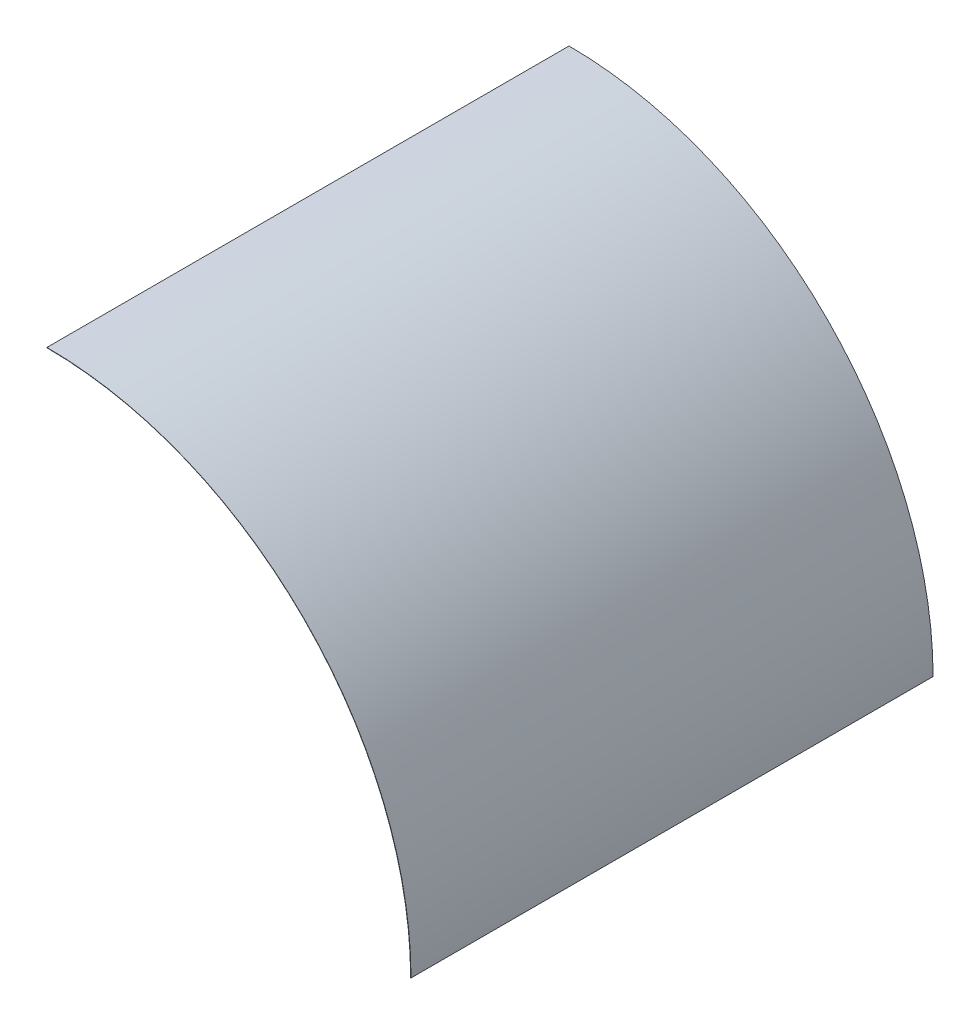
from build123d import *

# Parameters (mm, degrees)
BOSS_EXTRUDE1_DEPTH = 3000


with BuildPart() as part:
    # Sketch1 → Boss-Extrude1 (new body)
    with BuildSketch(Plane.XY):
        with BuildLine():
            Line((0, 2092), (0, 2090))
            ThreePointArc((0, 2090), (1477.85317268, 1477.85317268), (2090, 0))
            Line((2090, 0), (2092, 0))
            ThreePointArc((2092, 0), (1479.267386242, 1479.267386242), (0, 2092))
        make_face()
    extrude(amount=-BOSS_EXTRUDE1_DEPTH)


solid = part.part
